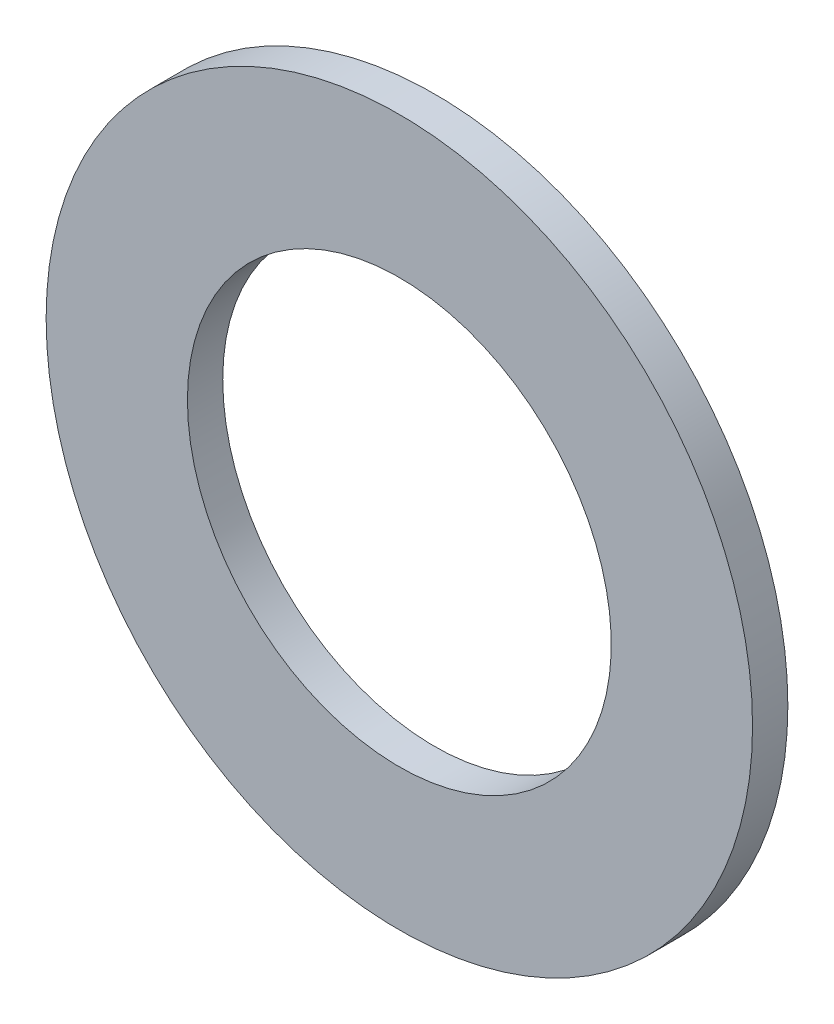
ISO-10303-21;
HEADER;
FILE_DESCRIPTION(('STEP AP214'),'2;1');
FILE_NAME('part.step','',(''),(''),'','','');
FILE_SCHEMA(('AUTOMOTIVE_DESIGN { 1 0 10303 214 1 1 1 1 }'));
ENDSEC;
DATA;
#1=APPLICATION_CONTEXT('core data for automotive mechanical design processes');
#2=APPLICATION_PROTOCOL_DEFINITION('international standard','automotive_design',2000,#1);
#3=PRODUCT_CONTEXT('',#1,'mechanical');
#4=PRODUCT('Part','Part','',(#3));
#5=PRODUCT_RELATED_PRODUCT_CATEGORY('part','',(#4));
#6=PRODUCT_DEFINITION_FORMATION('','',#4);
#7=PRODUCT_DEFINITION_CONTEXT('part definition',#1,'design');
#8=PRODUCT_DEFINITION('design','',#6,#7);
#9=PRODUCT_DEFINITION_SHAPE('','',#8);
#10=(LENGTH_UNIT() NAMED_UNIT(*) SI_UNIT(.MILLI.,.METRE.));
#11=(NAMED_UNIT(*) PLANE_ANGLE_UNIT() SI_UNIT($,.RADIAN.));
#12=(NAMED_UNIT(*) SI_UNIT($,.STERADIAN.) SOLID_ANGLE_UNIT());
#13=UNCERTAINTY_MEASURE_WITH_UNIT(LENGTH_MEASURE(1.E-05),#10,'distance_accuracy_value','');
#14=(GEOMETRIC_REPRESENTATION_CONTEXT(3) GLOBAL_UNCERTAINTY_ASSIGNED_CONTEXT((#13)) GLOBAL_UNIT_ASSIGNED_CONTEXT((#10,
#11,#12)) REPRESENTATION_CONTEXT('',''));
#15=CARTESIAN_POINT('',(0.,0.,0.));
#16=DIRECTION('',(0.,0.,1.));
#17=DIRECTION('',(1.,0.,0.));
#18=AXIS2_PLACEMENT_3D('',#15,#16,#17);
#19=CARTESIAN_POINT('',(0.,0.,0.250000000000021));
#20=DIRECTION('',(0.,0.,0.999999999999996));
#21=DIRECTION('',(0.999999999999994,0.,0.));
#22=AXIS2_PLACEMENT_3D('',#19,#20,#21);
#23=PLANE('',#22);
#24=CARTESIAN_POINT('',(0.,0.,0.250000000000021));
#25=DIRECTION('',(0.,0.,0.999999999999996));
#26=DIRECTION('',(0.999999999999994,0.,0.));
#27=AXIS2_PLACEMENT_3D('',#24,#25,#26);
#28=CIRCLE('',#27,2.5);
#29=CARTESIAN_POINT('',(-2.50000000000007,0.,0.250000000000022));
#30=VERTEX_POINT('',#29);
#31=EDGE_CURVE('E10',#30,#30,#28,.T.);
#32=ORIENTED_EDGE('',*,*,#31,.T.);
#33=EDGE_LOOP('',(#32));
#34=FACE_BOUND('',#33,.T.);
#35=CARTESIAN_POINT('',(0.,0.,0.250000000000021));
#36=DIRECTION('',(0.,0.,0.999999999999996));
#37=DIRECTION('',(0.999999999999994,0.,0.));
#38=AXIS2_PLACEMENT_3D('',#35,#36,#37);
#39=CIRCLE('',#38,1.5);
#40=CARTESIAN_POINT('',(-1.50000000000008,0.,0.250000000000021));
#41=VERTEX_POINT('',#40);
#42=EDGE_CURVE('E47',#41,#41,#39,.T.);
#43=ORIENTED_EDGE('',*,*,#42,.F.);
#44=EDGE_LOOP('',(#43));
#45=FACE_BOUND('',#44,.T.);
#46=ADVANCED_FACE('F36',(#34,#45),#23,.T.);
#47=CARTESIAN_POINT('',(0.,0.,0.));
#48=DIRECTION('',(0.,0.,0.999999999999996));
#49=DIRECTION('',(0.999999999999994,0.,0.));
#50=AXIS2_PLACEMENT_3D('',#47,#48,#49);
#51=PLANE('',#50);
#52=CARTESIAN_POINT('',(0.,0.,0.));
#53=DIRECTION('',(0.,0.,0.999999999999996));
#54=DIRECTION('',(0.999999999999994,0.,0.));
#55=AXIS2_PLACEMENT_3D('',#52,#53,#54);
#56=CIRCLE('',#55,2.5);
#57=CARTESIAN_POINT('',(-2.50000000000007,0.,0.));
#58=VERTEX_POINT('',#57);
#59=EDGE_CURVE('E43',#58,#58,#56,.T.);
#60=ORIENTED_EDGE('',*,*,#59,.F.);
#61=EDGE_LOOP('',(#60));
#62=FACE_BOUND('',#61,.T.);
#63=CARTESIAN_POINT('',(0.,0.,0.));
#64=DIRECTION('',(0.,0.,0.999999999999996));
#65=DIRECTION('',(0.999999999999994,0.,0.));
#66=AXIS2_PLACEMENT_3D('',#63,#64,#65);
#67=CIRCLE('',#66,1.5);
#68=CARTESIAN_POINT('',(-1.50000000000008,0.,0.));
#69=VERTEX_POINT('',#68);
#70=EDGE_CURVE('E51',#69,#69,#67,.T.);
#71=ORIENTED_EDGE('',*,*,#70,.T.);
#72=EDGE_LOOP('',(#71));
#73=FACE_BOUND('',#72,.T.);
#74=ADVANCED_FACE('F57',(#62,#73),#51,.F.);
#75=CARTESIAN_POINT('',(0.,0.,0.250000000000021));
#76=DIRECTION('',(0.,0.,-0.999999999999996));
#77=DIRECTION('',(-0.999999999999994,0.,0.));
#78=AXIS2_PLACEMENT_3D('',#75,#76,#77);
#79=CYLINDRICAL_SURFACE('',#78,2.5);
#80=CARTESIAN_POINT('',(-2.50000000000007,0.,0.250000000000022));
#81=CARTESIAN_POINT('',(-2.50000000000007,0.,0.247395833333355));
#82=CARTESIAN_POINT('',(-2.50000000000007,0.,0.244791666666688));
#83=CARTESIAN_POINT('',(-2.50000000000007,0.,0.239583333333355));
#84=CARTESIAN_POINT('',(-2.50000000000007,0.,0.236979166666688));
#85=CARTESIAN_POINT('',(-2.50000000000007,0.,0.231770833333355));
#86=CARTESIAN_POINT('',(-2.50000000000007,0.,0.229166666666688));
#87=CARTESIAN_POINT('',(-2.50000000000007,0.,0.223958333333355));
#88=CARTESIAN_POINT('',(-2.50000000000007,0.,0.221354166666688));
#89=CARTESIAN_POINT('',(-2.50000000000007,0.,0.216145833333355));
#90=CARTESIAN_POINT('',(-2.50000000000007,0.,0.213541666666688));
#91=CARTESIAN_POINT('',(-2.50000000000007,0.,0.208333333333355));
#92=CARTESIAN_POINT('',(-2.50000000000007,0.,0.205729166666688));
#93=CARTESIAN_POINT('',(-2.50000000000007,0.,0.200520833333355));
#94=CARTESIAN_POINT('',(-2.50000000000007,0.,0.197916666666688));
#95=CARTESIAN_POINT('',(-2.50000000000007,0.,0.192708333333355));
#96=CARTESIAN_POINT('',(-2.50000000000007,0.,0.190104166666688));
#97=CARTESIAN_POINT('',(-2.50000000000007,0.,0.184895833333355));
#98=CARTESIAN_POINT('',(-2.50000000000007,0.,0.182291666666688));
#99=CARTESIAN_POINT('',(-2.50000000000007,0.,0.177083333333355));
#100=CARTESIAN_POINT('',(-2.50000000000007,0.,0.174479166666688));
#101=CARTESIAN_POINT('',(-2.50000000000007,0.,0.169270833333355));
#102=CARTESIAN_POINT('',(-2.50000000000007,0.,0.166666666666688));
#103=CARTESIAN_POINT('',(-2.50000000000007,0.,0.161458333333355));
#104=CARTESIAN_POINT('',(-2.50000000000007,0.,0.158854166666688));
#105=CARTESIAN_POINT('',(-2.50000000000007,0.,0.153645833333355));
#106=CARTESIAN_POINT('',(-2.50000000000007,0.,0.151041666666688));
#107=CARTESIAN_POINT('',(-2.50000000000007,0.,0.145833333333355));
#108=CARTESIAN_POINT('',(-2.50000000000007,0.,0.143229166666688));
#109=CARTESIAN_POINT('',(-2.50000000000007,0.,0.138020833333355));
#110=CARTESIAN_POINT('',(-2.50000000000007,0.,0.135416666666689));
#111=CARTESIAN_POINT('',(-2.50000000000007,0.,0.130208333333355));
#112=CARTESIAN_POINT('',(-2.50000000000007,0.,0.127604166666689));
#113=CARTESIAN_POINT('',(-2.50000000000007,0.,0.122395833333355));
#114=CARTESIAN_POINT('',(-2.50000000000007,0.,0.119791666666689));
#115=CARTESIAN_POINT('',(-2.50000000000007,0.,0.114583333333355));
#116=CARTESIAN_POINT('',(-2.50000000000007,0.,0.111979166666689));
#117=CARTESIAN_POINT('',(-2.50000000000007,0.,0.106770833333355));
#118=CARTESIAN_POINT('',(-2.50000000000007,0.,0.104166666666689));
#119=CARTESIAN_POINT('',(-2.50000000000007,0.,0.0989583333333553));
#120=CARTESIAN_POINT('',(-2.50000000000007,0.,0.0963541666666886));
#121=CARTESIAN_POINT('',(-2.50000000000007,0.,0.0911458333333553));
#122=CARTESIAN_POINT('',(-2.50000000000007,0.,0.0885416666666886));
#123=CARTESIAN_POINT('',(-2.50000000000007,0.,0.0833333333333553));
#124=CARTESIAN_POINT('',(-2.50000000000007,0.,0.0807291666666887));
#125=CARTESIAN_POINT('',(-2.50000000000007,0.,0.0755208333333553));
#126=CARTESIAN_POINT('',(-2.50000000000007,0.,0.0729166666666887));
#127=CARTESIAN_POINT('',(-2.50000000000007,0.,0.0677083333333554));
#128=CARTESIAN_POINT('',(-2.50000000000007,0.,0.0651041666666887));
#129=CARTESIAN_POINT('',(-2.50000000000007,0.,0.0598958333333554));
#130=CARTESIAN_POINT('',(-2.50000000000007,0.,0.0572916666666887));
#131=CARTESIAN_POINT('',(-2.50000000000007,0.,0.0520833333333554));
#132=CARTESIAN_POINT('',(-2.50000000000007,0.,0.0494791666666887));
#133=CARTESIAN_POINT('',(-2.50000000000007,0.,0.0442708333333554));
#134=CARTESIAN_POINT('',(-2.50000000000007,0.,0.0416666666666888));
#135=CARTESIAN_POINT('',(-2.50000000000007,0.,0.0364583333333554));
#136=CARTESIAN_POINT('',(-2.50000000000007,0.,0.0338541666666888));
#137=CARTESIAN_POINT('',(-2.50000000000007,0.,0.0286458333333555));
#138=CARTESIAN_POINT('',(-2.50000000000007,0.,0.0260416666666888));
#139=CARTESIAN_POINT('',(-2.50000000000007,0.,0.0208333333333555));
#140=CARTESIAN_POINT('',(-2.50000000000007,0.,0.0182291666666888));
#141=CARTESIAN_POINT('',(-2.50000000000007,0.,0.0130208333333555));
#142=CARTESIAN_POINT('',(-2.50000000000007,0.,0.0104166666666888));
#143=CARTESIAN_POINT('',(-2.50000000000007,0.,0.00520833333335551));
#144=CARTESIAN_POINT('',(-2.50000000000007,0.,0.00260416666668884));
#145=CARTESIAN_POINT('',(-2.50000000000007,0.,0.));
#146=B_SPLINE_CURVE_WITH_KNOTS('',3,(#80,#81,#82,#83,#84,#85,#86,#87,#88,#89,#90,#91,#92,#93,
#94,#95,#96,#97,#98,#99,#100,#101,#102,#103,#104,#105,#106,#107,#108,#109,#110,#111,#112,#113,
#114,#115,#116,#117,#118,#119,#120,#121,#122,#123,#124,#125,#126,#127,#128,#129,#130,#131,#132,
#133,#134,#135,#136,#137,#138,#139,#140,#141,#142,#143,#144,#145),.UNSPECIFIED.,.F.,.F.,(4,2,2,
2,2,2,2,2,2,2,2,2,2,2,2,2,2,2,2,2,2,2,2,2,2,2,2,2,2,2,2,2,4),(0.,0.00781249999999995,
0.0156249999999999,0.0234374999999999,0.0312499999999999,0.0390624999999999,0.0468749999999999,
0.0546874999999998,0.0624999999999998,0.0703124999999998,0.0781249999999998,0.0859374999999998,
0.0937499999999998,0.1015625,0.109375,0.1171875,0.125,0.1328125,0.140625,0.1484375,0.15625,
0.1640625,0.171875,0.1796875,0.1875,0.1953125,0.203124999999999,0.210937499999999,
0.218749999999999,0.226562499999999,0.234374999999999,0.242187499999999,0.249999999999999),.UNSPECIFIED.);
#147=EDGE_CURVE('BSEAM38',#30,#58,#146,.T.);
#148=ORIENTED_EDGE('',*,*,#31,.F.);
#149=ORIENTED_EDGE('',*,*,#59,.T.);
#150=ORIENTED_EDGE('',*,*,#147,.T.);
#151=ORIENTED_EDGE('',*,*,#147,.F.);
#152=EDGE_LOOP('',(#148,#150,#149,#151));
#153=FACE_BOUND('',#152,.T.);
#154=ADVANCED_FACE('F38',(#153),#79,.T.);
#155=CARTESIAN_POINT('',(0.,0.,0.250000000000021));
#156=DIRECTION('',(0.,0.,-0.999999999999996));
#157=DIRECTION('',(-0.999999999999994,0.,0.));
#158=AXIS2_PLACEMENT_3D('',#155,#156,#157);
#159=CYLINDRICAL_SURFACE('',#158,1.5);
#160=CARTESIAN_POINT('',(-1.50000000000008,0.,0.250000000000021));
#161=CARTESIAN_POINT('',(-1.50000000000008,0.,0.247395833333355));
#162=CARTESIAN_POINT('',(-1.50000000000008,0.,0.244791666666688));
#163=CARTESIAN_POINT('',(-1.50000000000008,0.,0.239583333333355));
#164=CARTESIAN_POINT('',(-1.50000000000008,0.,0.236979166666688));
#165=CARTESIAN_POINT('',(-1.50000000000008,0.,0.231770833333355));
#166=CARTESIAN_POINT('',(-1.50000000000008,0.,0.229166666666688));
#167=CARTESIAN_POINT('',(-1.50000000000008,0.,0.223958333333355));
#168=CARTESIAN_POINT('',(-1.50000000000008,0.,0.221354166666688));
#169=CARTESIAN_POINT('',(-1.50000000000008,0.,0.216145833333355));
#170=CARTESIAN_POINT('',(-1.50000000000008,0.,0.213541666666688));
#171=CARTESIAN_POINT('',(-1.50000000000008,0.,0.208333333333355));
#172=CARTESIAN_POINT('',(-1.50000000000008,0.,0.205729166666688));
#173=CARTESIAN_POINT('',(-1.50000000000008,0.,0.200520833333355));
#174=CARTESIAN_POINT('',(-1.50000000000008,0.,0.197916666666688));
#175=CARTESIAN_POINT('',(-1.50000000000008,0.,0.192708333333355));
#176=CARTESIAN_POINT('',(-1.50000000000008,0.,0.190104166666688));
#177=CARTESIAN_POINT('',(-1.50000000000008,0.,0.184895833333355));
#178=CARTESIAN_POINT('',(-1.50000000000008,0.,0.182291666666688));
#179=CARTESIAN_POINT('',(-1.50000000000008,0.,0.177083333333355));
#180=CARTESIAN_POINT('',(-1.50000000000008,0.,0.174479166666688));
#181=CARTESIAN_POINT('',(-1.50000000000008,0.,0.169270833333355));
#182=CARTESIAN_POINT('',(-1.50000000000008,0.,0.166666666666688));
#183=CARTESIAN_POINT('',(-1.50000000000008,0.,0.161458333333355));
#184=CARTESIAN_POINT('',(-1.50000000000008,0.,0.158854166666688));
#185=CARTESIAN_POINT('',(-1.50000000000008,0.,0.153645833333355));
#186=CARTESIAN_POINT('',(-1.50000000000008,0.,0.151041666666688));
#187=CARTESIAN_POINT('',(-1.50000000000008,0.,0.145833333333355));
#188=CARTESIAN_POINT('',(-1.50000000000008,0.,0.143229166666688));
#189=CARTESIAN_POINT('',(-1.50000000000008,0.,0.138020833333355));
#190=CARTESIAN_POINT('',(-1.50000000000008,0.,0.135416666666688));
#191=CARTESIAN_POINT('',(-1.50000000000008,0.,0.130208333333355));
#192=CARTESIAN_POINT('',(-1.50000000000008,0.,0.127604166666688));
#193=CARTESIAN_POINT('',(-1.50000000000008,0.,0.122395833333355));
#194=CARTESIAN_POINT('',(-1.50000000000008,0.,0.119791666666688));
#195=CARTESIAN_POINT('',(-1.50000000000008,0.,0.114583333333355));
#196=CARTESIAN_POINT('',(-1.50000000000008,0.,0.111979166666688));
#197=CARTESIAN_POINT('',(-1.50000000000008,0.,0.106770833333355));
#198=CARTESIAN_POINT('',(-1.50000000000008,0.,0.104166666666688));
#199=CARTESIAN_POINT('',(-1.50000000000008,0.,0.098958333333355));
#200=CARTESIAN_POINT('',(-1.50000000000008,0.,0.0963541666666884));
#201=CARTESIAN_POINT('',(-1.50000000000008,0.,0.091145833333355));
#202=CARTESIAN_POINT('',(-1.50000000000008,0.,0.0885416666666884));
#203=CARTESIAN_POINT('',(-1.50000000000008,0.,0.083333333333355));
#204=CARTESIAN_POINT('',(-1.50000000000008,0.,0.0807291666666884));
#205=CARTESIAN_POINT('',(-1.50000000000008,0.,0.0755208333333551));
#206=CARTESIAN_POINT('',(-1.50000000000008,0.,0.0729166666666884));
#207=CARTESIAN_POINT('',(-1.50000000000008,0.,0.0677083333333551));
#208=CARTESIAN_POINT('',(-1.50000000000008,0.,0.0651041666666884));
#209=CARTESIAN_POINT('',(-1.50000000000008,0.,0.0598958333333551));
#210=CARTESIAN_POINT('',(-1.50000000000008,0.,0.0572916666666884));
#211=CARTESIAN_POINT('',(-1.50000000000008,0.,0.0520833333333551));
#212=CARTESIAN_POINT('',(-1.50000000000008,0.,0.0494791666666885));
#213=CARTESIAN_POINT('',(-1.50000000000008,0.,0.0442708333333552));
#214=CARTESIAN_POINT('',(-1.50000000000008,0.,0.0416666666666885));
#215=CARTESIAN_POINT('',(-1.50000000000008,0.,0.0364583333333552));
#216=CARTESIAN_POINT('',(-1.50000000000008,0.,0.0338541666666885));
#217=CARTESIAN_POINT('',(-1.50000000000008,0.,0.0286458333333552));
#218=CARTESIAN_POINT('',(-1.50000000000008,0.,0.0260416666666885));
#219=CARTESIAN_POINT('',(-1.50000000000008,0.,0.0208333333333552));
#220=CARTESIAN_POINT('',(-1.50000000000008,0.,0.0182291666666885));
#221=CARTESIAN_POINT('',(-1.50000000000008,0.,0.0130208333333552));
#222=CARTESIAN_POINT('',(-1.50000000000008,0.,0.0104166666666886));
#223=CARTESIAN_POINT('',(-1.50000000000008,0.,0.00520833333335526));
#224=CARTESIAN_POINT('',(-1.50000000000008,0.,0.00260416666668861));
#225=CARTESIAN_POINT('',(-1.50000000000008,0.,0.));
#226=B_SPLINE_CURVE_WITH_KNOTS('',3,(#160,#161,#162,#163,#164,#165,#166,#167,#168,#169,#170,
#171,#172,#173,#174,#175,#176,#177,#178,#179,#180,#181,#182,#183,#184,#185,#186,#187,#188,#189,
#190,#191,#192,#193,#194,#195,#196,#197,#198,#199,#200,#201,#202,#203,#204,#205,#206,#207,#208,
#209,#210,#211,#212,#213,#214,#215,#216,#217,#218,#219,#220,#221,#222,#223,#224,#225),
.UNSPECIFIED.,.F.,.F.,(4,2,2,2,2,2,2,2,2,2,2,2,2,2,2,2,2,2,2,2,2,2,2,2,2,2,2,2,2,2,2,2,4),(0.,
0.00781250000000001,0.015625,0.0234375,0.0312499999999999,0.0390624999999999,0.0468749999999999,
0.0546874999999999,0.0624999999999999,0.0703124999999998,0.0781249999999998,0.0859374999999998,
0.0937499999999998,0.1015625,0.109375,0.1171875,0.125,0.1328125,0.140625,0.1484375,0.15625,
0.1640625,0.171875,0.1796875,0.1875,0.1953125,0.203125,0.2109375,0.21875,0.2265625,
0.234374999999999,0.242187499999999,0.249999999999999),.UNSPECIFIED.);
#227=EDGE_CURVE('BSEAM59',#41,#69,#226,.T.);
#228=ORIENTED_EDGE('',*,*,#42,.T.);
#229=ORIENTED_EDGE('',*,*,#70,.F.);
#230=ORIENTED_EDGE('',*,*,#227,.T.);
#231=ORIENTED_EDGE('',*,*,#227,.F.);
#232=EDGE_LOOP('',(#228,#230,#229,#231));
#233=FACE_BOUND('',#232,.T.);
#234=ADVANCED_FACE('F59',(#233),#159,.F.);
#235=CLOSED_SHELL('',(#46,#74,#154,#234));
#236=MANIFOLD_SOLID_BREP('B2',#235);
#237=ADVANCED_BREP_SHAPE_REPRESENTATION('',(#18,#236),#14);
#238=SHAPE_DEFINITION_REPRESENTATION(#9,#237);
ENDSEC;
END-ISO-10303-21;
